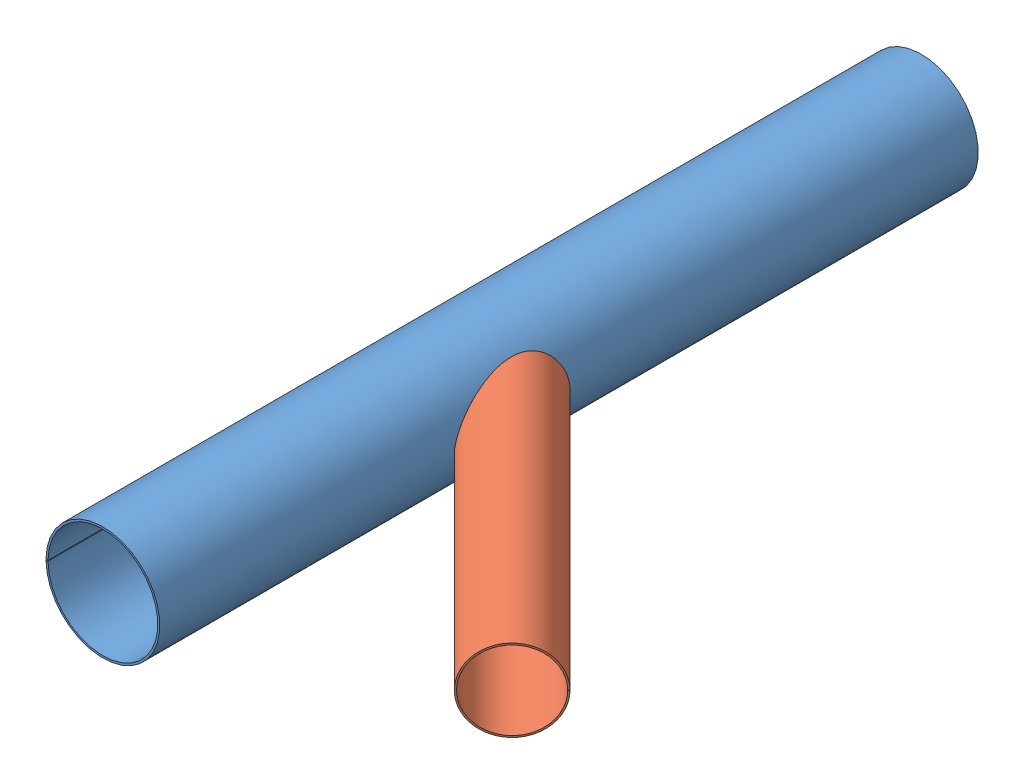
SolidWorks assembly ROHR ans ROHR anders.SLDASM, configuration Standard (file format 3400). Lengths in mm.
Overall size (458.41 139 1087.12).
2 component instances, 2 part files, 5 mates.
Components (placement in the parent):
- HAUPTROHR-1: HAUPTROHR.SLDPRT [Standard] at origin size (423.05 139 1087.12)
- NEBENROHR-1: NEBENROHR.SLDPRT [Standard] at (353.5534 0 353.5534) x (0.707107 0 -0.707107) z (0.707107 0 0.707107) size (100.01 100.02 449.72)
Mates (geometry in assembly coordinates):
- Platziert1: in place: plane of NEBENROHR-1
- Deckungsgleich1: coincident aligned: plane of ?; plane of assembly
- Deckungsgleich2: coincident aligned: plane of ?; moOrthogonalPlaneRef_w of assembly
- Deckungsgleich3: coincident anti-aligned: 
- EBENE1: unknown: point of HAUPTROHR-1; line of HAUPTROHR-1
